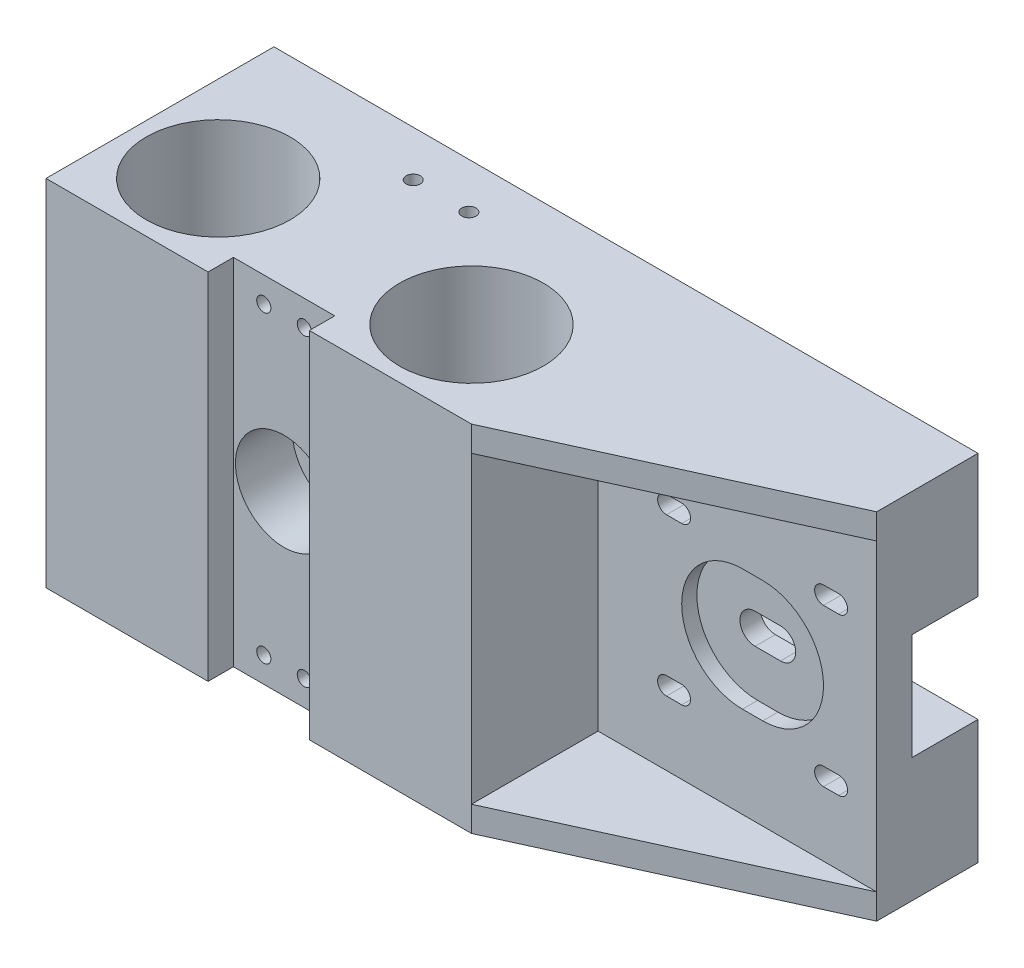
from build123d import *

# Parameters (mm, degrees)
SKETCH_1_R           = 14.2
EXTRUDE_1_DEPTH      = 70
SKETCH_2_R           = 1.4
CUT_EXTRUDE_1_DEPTH  = 5
SKETCH_3_R           = 9.6
CUT_EXTRUDE_2_DEPTH  = 11.2
CUT_EXTRUDE_START    = -19
SKETCH_4_R           = 9.6
CUT_EXTRUDE_3_DEPTH  = 19
SKETCH_5_W           = 20
SKETCH_5_H           = 70
EXTRUDE_2_DEPTH      = 55
SKETCH_6_W           = 107
SKETCH_6_H           = 21
CUT_EXTRUDE_4_DEPTH  = 13
EXTRUDE_3_DEPTH      = 5
EXTRUDE_4_DEPTH      = 5
CUT_EXTRUDE_5_DEPTH  = 68
SKETCH_10_R          = 3.25
CUT_EXTRUDE_6_DEPTH  = 68
CUT_EXTRUDE_7_DEPTH  = 3
CUT_EXTRUDE_8_DEPTH  = 123.853571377
CUT_EXTRUDE_10_DEPTH = 5
SKETCH_15_R          = 1.4
CUT_EXTRUDE_11_DEPTH = 5
SKETCH_17_R          = 1.4
CUT_EXTRUDE_12_DEPTH = 5


with BuildPart() as part:
    # Sketch 1 → Extrude 1 (new body)
    # profile 1 of 3: a face of its own
    with BuildSketch(Plane(origin=(0, 0, 0), x_dir=(1, 0, 0), z_dir=(0, 1, 0))):
        Polygon((-10, 0), (-10, -5), (-42, -5), (-42, 40), (0, 40), (42, 40), (42, -5), (10, -5), (10, 0), align=None)
        with Locations(Location((-25, 12, 0), (0, 0, 270))):
            Circle(SKETCH_1_R, mode=Mode.SUBTRACT)
        with Locations(Location((25, 12, 0), (0, 0, 270))):
            Circle(SKETCH_1_R, mode=Mode.SUBTRACT)
    # profile 2 of 3: a face of its own
    with BuildSketch(Plane(origin=(0, 0, 0), x_dir=(1, 0, 0), z_dir=(0, 1, 0))):
        Polygon((-10, 0), (10, 0), (10, -5), (42, -5), (42, 40), (0, 40), (-42, 40), (-42, -5), (-10, -5), align=None)
        with Locations(Location((-25, 12, 0), (0, 0, 270))):
            Circle(SKETCH_1_R, mode=Mode.SUBTRACT)
        with Locations(Location((25, 12, 0), (0, 0, 270))):
            Circle(SKETCH_1_R, mode=Mode.SUBTRACT)
    # profile 3 of 3: a face of its own
    with BuildSketch(Plane(origin=(0, 0, 0), x_dir=(1, 0, 0), z_dir=(0, 1, 0))):
        Polygon((-10, 0), (10, 0), (10, -5), (42, -5), (42, 40), (0, 40), (-42, 40), (-42, -5), (-10, -5), align=None)
        with Locations(Location((-25, 12, 0), (0, 0, 270))):
            Circle(SKETCH_1_R, mode=Mode.SUBTRACT)
        with Locations(Location((25, 12, 0), (0, 0, 270))):
            Circle(SKETCH_1_R, mode=Mode.SUBTRACT)
    extrude(amount=EXTRUDE_1_DEPTH)

    # Sketch 2 → Cut-Extrude 1 (cut)
    with BuildSketch(Plane.XY):
        with Locations((-4, 65)):
            Circle(SKETCH_2_R)
        with Locations(Location((-4, 5, 0), (0, 0, 180))):
            Circle(SKETCH_2_R)
        with Locations((4, 5)):
            Circle(SKETCH_2_R)
        with Locations(Location((4, 65, 0), (0, 0, 180))):
            Circle(SKETCH_2_R)
    extrude(amount=-CUT_EXTRUDE_1_DEPTH, mode=Mode.SUBTRACT)

    # Sketch 3 → Cut-Extrude 2 (cut)
    with BuildSketch(Plane.XY):
        with Locations((0, 35)):
            Circle(SKETCH_3_R)
    extrude(amount=-CUT_EXTRUDE_2_DEPTH, mode=Mode.SUBTRACT)

    # Sketch 4 → Cut-Extrude 3 (cut)
    with BuildSketch(Plane(origin=(0, 0, -40), x_dir=(-1, 0, 0), z_dir=(0, 0, -1)).offset(CUT_EXTRUDE_START)):
        with Locations(Location((0, 35, 0), (0, 0, 180))):
            Circle(SKETCH_4_R)
    extrude(amount=CUT_EXTRUDE_3_DEPTH, mode=Mode.SUBTRACT)

    # Sketch 5 → Extrude 2 (add)
    with BuildSketch(Plane(origin=(42, 0, 0), x_dir=(0, 0, -1), z_dir=(1, 0, 0))):
        with Locations((30, 35)):
            Rectangle(SKETCH_5_W, SKETCH_5_H)
    extrude(amount=EXTRUDE_2_DEPTH)

    # Sketch 6 → Cut-Extrude 4 (cut)
    with BuildSketch(Plane(origin=(0, 0, -40), x_dir=(-1, 0, 0), z_dir=(0, 0, -1))):
        with Locations((-43.5, 35)):
            Rectangle(SKETCH_6_W, SKETCH_6_H)
    extrude(amount=-CUT_EXTRUDE_4_DEPTH, mode=Mode.SUBTRACT)

    # Sketch 7 → Extrude 3 (add)
    with BuildSketch(Plane(origin=(0, 70, 0), x_dir=(1, 0, 0), z_dir=(0, 1, 0))):
        Polygon((42, -5), (97, 20), (42, 20), align=None)
    extrude(amount=-EXTRUDE_3_DEPTH)

    # Sketch 8 → Extrude 4 (add)
    with BuildSketch(Plane.XZ):
        Polygon((42, 5), (97, -20), (42, -20), align=None)
    extrude(amount=-EXTRUDE_4_DEPTH)

    # Sketch 9 → Cut-Extrude 5 (cut)
    with BuildSketch(Plane(origin=(0, 0, -40), x_dir=(-1, 0, 0), z_dir=(0, 0, -1))):
        with BuildLine():
            Line((-89.5, 52.25), (-86.5, 52.25))
            ThreePointArc((-86.5, 52.25), (-84.75, 50.5), (-86.5, 48.75))
            Line((-86.5, 48.75), (-89.5, 48.75))
            ThreePointArc((-89.5, 48.75), (-91.25, 50.5), (-89.5, 52.25))
        make_face()
        with BuildLine():
            Line((-58.5, 52.25), (-55.5, 52.25))
            ThreePointArc((-55.5, 52.25), (-53.75, 50.5), (-55.5, 48.75))
            Line((-55.5, 48.75), (-58.5, 48.75))
            ThreePointArc((-58.5, 48.75), (-60.25, 50.5), (-58.5, 52.25))
        make_face()
        with BuildLine():
            Line((-89.5, 21.25), (-86.5, 21.25))
            ThreePointArc((-86.5, 21.25), (-84.75, 19.5), (-86.5, 17.75))
            Line((-86.5, 17.75), (-89.5, 17.75))
            ThreePointArc((-89.5, 17.75), (-91.25, 19.5), (-89.5, 21.25))
        make_face()
        with BuildLine():
            Line((-58.5, 21.25), (-55.5, 21.25))
            ThreePointArc((-55.5, 21.25), (-53.75, 19.5), (-55.5, 17.75))
            Line((-55.5, 17.75), (-58.5, 17.75))
            ThreePointArc((-58.5, 17.75), (-60.25, 19.5), (-58.5, 21.25))
        make_face()
    extrude(amount=-CUT_EXTRUDE_5_DEPTH, mode=Mode.SUBTRACT)

    # Sketch 10 → Cut-Extrude 6 (cut)
    with BuildSketch(Plane(origin=(0, 0, -21), x_dir=(-1, 0, 0), z_dir=(0, 0, -1))):
        with Locations((0, 35)):
            Circle(SKETCH_10_R)
    extrude(amount=-CUT_EXTRUDE_6_DEPTH, mode=Mode.SUBTRACT)

    # Sketch 11 → Cut-Extrude 7 (cut)
    with BuildSketch(Plane.XY.offset(-20)):
        with BuildLine():
            Line((70.5, 47), (74.5, 47))
            ThreePointArc((74.5, 47), (86.5, 35), (74.5, 23))
            Line((74.5, 23), (70.5, 23))
            ThreePointArc((70.5, 23), (58.5, 35), (70.5, 47))
        make_face()
    extrude(amount=-CUT_EXTRUDE_7_DEPTH, mode=Mode.SUBTRACT)

    # Sketch 12 → Cut-Extrude 8 (cut, through all)
    with BuildSketch(Plane.XY.offset(-23)):
        with BuildLine():
            Line((70, 38), (75, 38))
            ThreePointArc((75, 38), (78, 35), (75, 32))
            Line((75, 32), (70, 32))
            ThreePointArc((70, 32), (67, 35), (70, 38))
        make_face()
    extrude(amount=-CUT_EXTRUDE_8_DEPTH, mode=Mode.SUBTRACT)

    # Sketch 14 → Cut-Extrude 10 (cut)
    with BuildSketch(Plane(origin=(0, 0, -40), x_dir=(-1, 0, 0), z_dir=(0, 0, -1))):
        with BuildLine():
            Line((-90, 53.5), (-86, 53.5))
            ThreePointArc((-86, 53.5), (-83, 50.5), (-86, 47.5))
            Line((-86, 47.5), (-90, 47.5))
            ThreePointArc((-90, 47.5), (-93, 50.5), (-90, 53.5))
        make_face()
        with BuildLine():
            Line((-59, 53.5), (-55, 53.5))
            ThreePointArc((-55, 53.5), (-52, 50.5), (-55, 47.5))
            Line((-55, 47.5), (-59, 47.5))
            ThreePointArc((-59, 47.5), (-62, 50.5), (-59, 53.5))
        make_face()
        with BuildLine():
            Line((-90, 22.5), (-86, 22.5))
            ThreePointArc((-86, 22.5), (-83, 19.5), (-86, 16.5))
            Line((-86, 16.5), (-90, 16.5))
            ThreePointArc((-90, 16.5), (-93, 19.5), (-90, 22.5))
        make_face()
        with BuildLine():
            Line((-59, 22.5), (-55, 22.5))
            ThreePointArc((-55, 22.5), (-52, 19.5), (-55, 16.5))
            Line((-55, 16.5), (-59, 16.5))
            ThreePointArc((-59, 16.5), (-62, 19.5), (-59, 22.5))
        make_face()
    extrude(amount=-CUT_EXTRUDE_10_DEPTH, mode=Mode.SUBTRACT)

    # Sketch 15 → Cut-Extrude 11 (cut)
    with BuildSketch(Plane(origin=(0, 0, -40), x_dir=(-1, 0, 0), z_dir=(0, 0, -1))):
        with Locations((-92, 65)):
            Circle(SKETCH_15_R)
        with Locations((37, 65)):
            Circle(SKETCH_15_R)
        with Locations((37, 5)):
            Circle(SKETCH_15_R)
        with Locations((-92, 5)):
            Circle(SKETCH_15_R)
        with Locations((-27.5, 65)):
            Circle(SKETCH_15_R)
        with Locations((-27.5, 5)):
            Circle(SKETCH_15_R)
    extrude(amount=-CUT_EXTRUDE_11_DEPTH, mode=Mode.SUBTRACT)

    # Sketch 17 → Cut-Extrude 12 (cut)
    with BuildSketch(Plane(origin=(0, 70, 0), x_dir=(1, 0, 0), z_dir=(0, 1, 0))):
        with Locations(Location((-5.5, 31, 0), (0, 0, 270))):
            Circle(SKETCH_17_R)
        with Locations(Location((5.5, 31, 0), (0, 0, 270))):
            Circle(SKETCH_17_R)
    cut_extrude_12 = extrude(amount=-CUT_EXTRUDE_12_DEPTH, mode=Mode.SUBTRACT)

    # Mirror 1: Cut-Extrude 12 across plane
    add(cut_extrude_12.mirror(Plane(origin=(0, 35, 0), x_dir=(0, 0, 1), z_dir=(0, -1, 0))), mode=Mode.SUBTRACT)


solid = part.part
